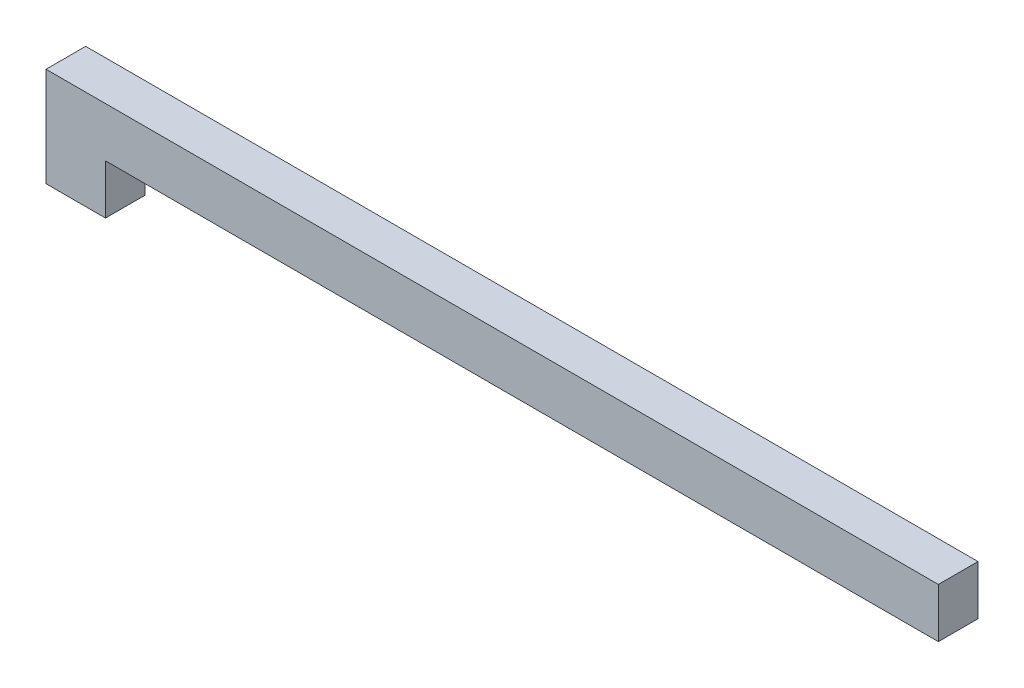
from build123d import *

# Parameters (mm, degrees)
BOSS_EXTRUDE1_DEPTH = 2


with BuildPart() as part:
    # Sketch1 → Boss-Extrude1 (new body)
    with BuildSketch(Plane.XY):
        Polygon((0, 0), (0, -2.5), (-3, -2.5), (-3, 2.5), (42, 2.5), (42, 0), align=None)
    extrude(amount=BOSS_EXTRUDE1_DEPTH)


solid = part.part
